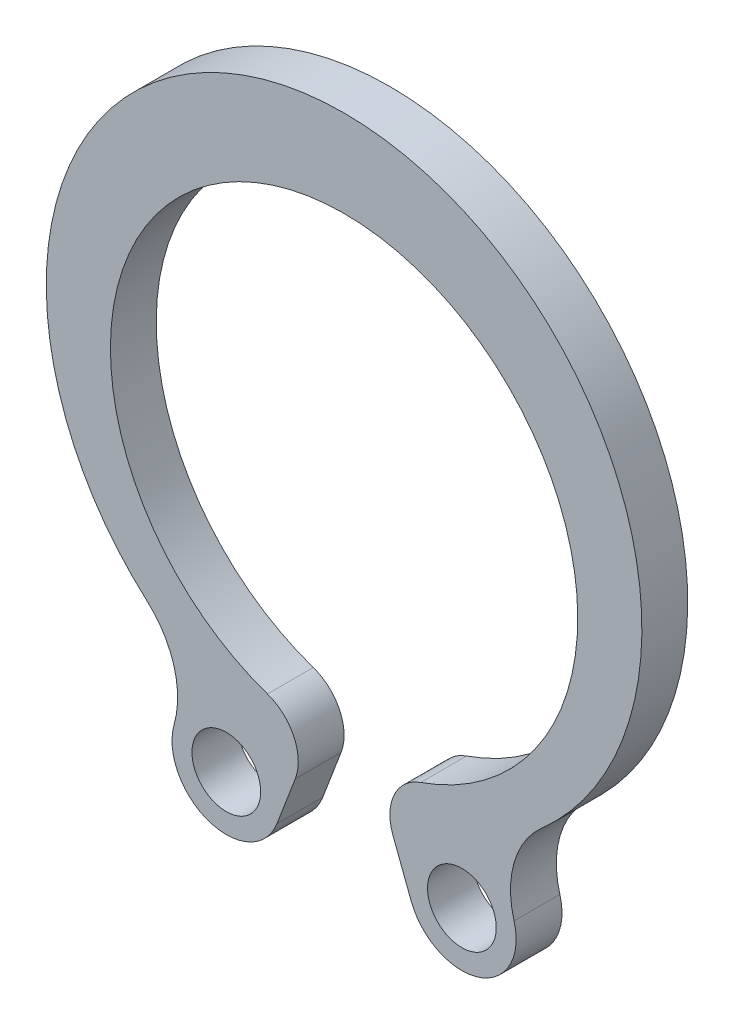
from build123d import *

# Parameters (mm, degrees)
SKETCH1_R  = 0.75
BODY_DEPTH = 1


with BuildPart() as part:
    # Sketch1 → Body (new body)
    with BuildSketch(Plane.XY):
        with BuildLine():
            Line((1.065632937, -6.119123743), (1.46405029, -7.163905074))
            ThreePointArc((1.46405029, -7.163905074), (2.945253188, -7.865736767), (3.709845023, -6.41593365))
            ThreePointArc((3.709845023, -6.41593365), (3.712725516, -5.305613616), (4.307346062, -4.367932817))
            ThreePointArc((4.307346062, -4.367932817), (0, 7), (-4.307346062, -4.367932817))
            ThreePointArc((-4.307346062, -4.367932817), (-3.712725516, -5.305613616), (-3.709845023, -6.41593365))
            ThreePointArc((-3.709845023, -6.41593365), (-2.945253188, -7.865736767), (-1.46405029, -7.163905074))
            Line((-1.46405029, -7.163905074), (-1.065632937, -6.119123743))
            ThreePointArc((-1.065632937, -6.119123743), (-1.093643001, -5.340299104), (-1.672131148, -4.818088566))
            ThreePointArc((-1.672131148, -4.818088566), (0, 5.1), (1.672131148, -4.818088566))
            ThreePointArc((1.672131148, -4.818088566), (1.093643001, -5.340299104), (1.065632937, -6.119123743))
        make_face()
        with Locations((-2.570924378, -6.741809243)):
            Circle(SKETCH1_R, mode=Mode.SUBTRACT)
        with Locations(Location((2.570924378, -6.741809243, 0), (0, 0, 180))):
            Circle(SKETCH1_R, mode=Mode.SUBTRACT)
    extrude(amount=BODY_DEPTH)


solid = part.part
